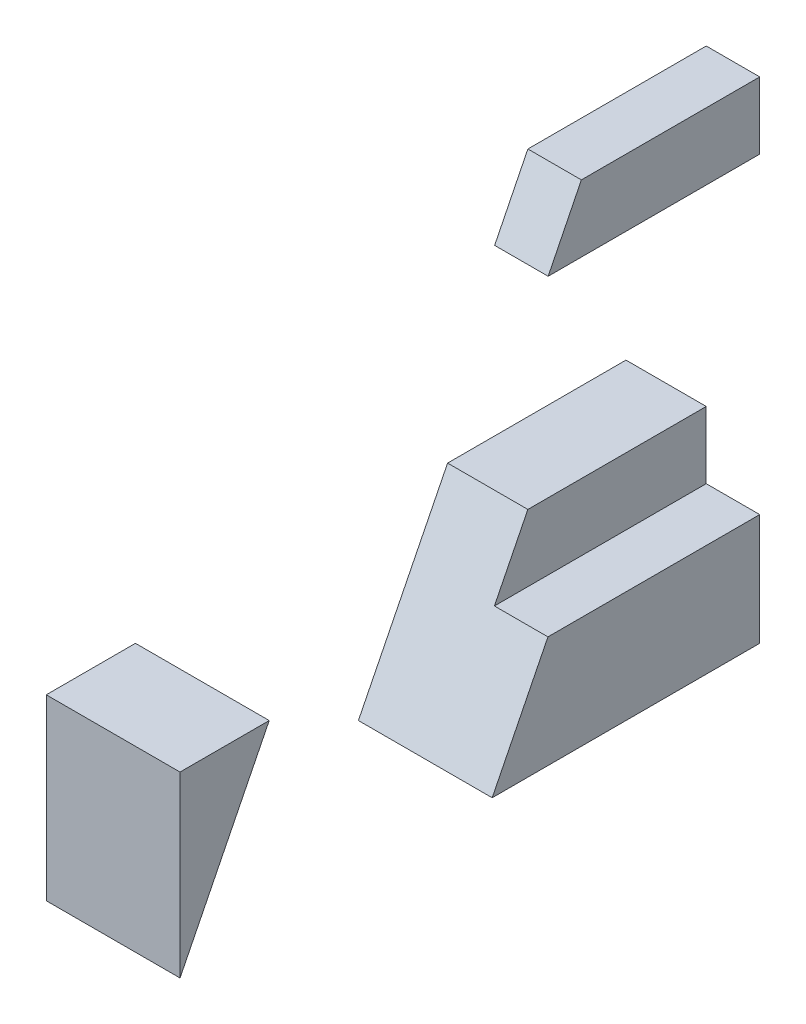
from build123d import *

# Parameters (mm, degrees)
SKETCH_1_W           = 30
SKETCH_1_H           = 60
EXTRUDE_1_DEPTH      = 40
EXTRUDE_2_DEPTH      = 15
CUT_EXTRUDE_START    = 15
CUT_EXTRUDE_1_DEPTH  = 30
EXTRUDE_3_DEPTH      = 15
CUT_EXTRUDE_START_2  = -60
SKETCH_8_OUTSIDE_W   = 66.584
SKETCH_8_OUTSIDE_H   = 146.584
SKETCH_8_OUTSIDE_W_2 = 12
SKETCH_8_OUTSIDE_H_2 = 15
CUT_EXTRUDE_2_DEPTH  = 60
SKETCH_9_W           = 12
SKETCH_9_H           = 15
CUT_EXTRUDE_3_DEPTH  = 50


with BuildPart() as part:
    # Sketch 1 → Extrude 1 (new body)
    with BuildSketch(Plane(origin=(0, 0, 0), x_dir=(1, 0, 0), z_dir=(0, 1, 0))):
        Rectangle(SKETCH_1_W, SKETCH_1_H)
    extrude(amount=EXTRUDE_1_DEPTH)

    # Sketch 6 → Cut-Extrude 1 (cut)
    with BuildSketch(Plane(origin=(0, 0, 0), x_dir=(0, 0, -1), z_dir=(1, 0, 0)).offset(CUT_EXTRUDE_START)):
        Polygon((-30, 40), (-10, 40), (-30, 0), align=None)
    extrude(amount=-CUT_EXTRUDE_1_DEPTH, mode=Mode.SUBTRACT)

    # Sketch 9 → Cut-Extrude 3 (cut)
    with BuildSketch(Plane(origin=(0, 0, -30), x_dir=(-1, 0, 0), z_dir=(0, 0, -1))):
        with Locations((-9, 32.5)):
            Rectangle(SKETCH_9_W, SKETCH_9_H)
    extrude(amount=-CUT_EXTRUDE_3_DEPTH, mode=Mode.SUBTRACT)


with BuildPart() as body_2:
    # Sketch 4 → Extrude 2 (new, symmetric)
    with BuildSketch(Plane(origin=(0, 0, 0), x_dir=(0, 0, -1), z_dir=(1, 0, 0))):
        Polygon((-100, 40), (-80, 40), (-100, 0), align=None)
    extrude(amount=EXTRUDE_2_DEPTH, both=True)


with BuildPart() as body_3:
    # Sketch 7 → Extrude 3 (new, symmetric)
    with BuildSketch(Plane(origin=(0, 0, 0), x_dir=(0, 0, -1), z_dir=(1, 0, 0))):
        Polygon((30, 110), (30, 69.722579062), (-30, 69.722579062), (-10, 110), align=None)
    extrude(amount=EXTRUDE_3_DEPTH, both=True)

    # Sketch 8 outside → Cut-Extrude 2 (cut)
    with BuildSketch(Plane(origin=(0, 0, -30), x_dir=(-1, 0, 0), z_dir=(0, 0, -1)).offset(CUT_EXTRUDE_START_2)):
        with Locations((0, 55)):
            Rectangle(SKETCH_8_OUTSIDE_W, SKETCH_8_OUTSIDE_H)
        with Locations((-9, 102.5)):
            Rectangle(SKETCH_8_OUTSIDE_W_2, SKETCH_8_OUTSIDE_H_2, mode=Mode.SUBTRACT)
    extrude(amount=CUT_EXTRUDE_2_DEPTH, mode=Mode.SUBTRACT)


solid = Compound([part.part, body_2.part, body_3.part])
